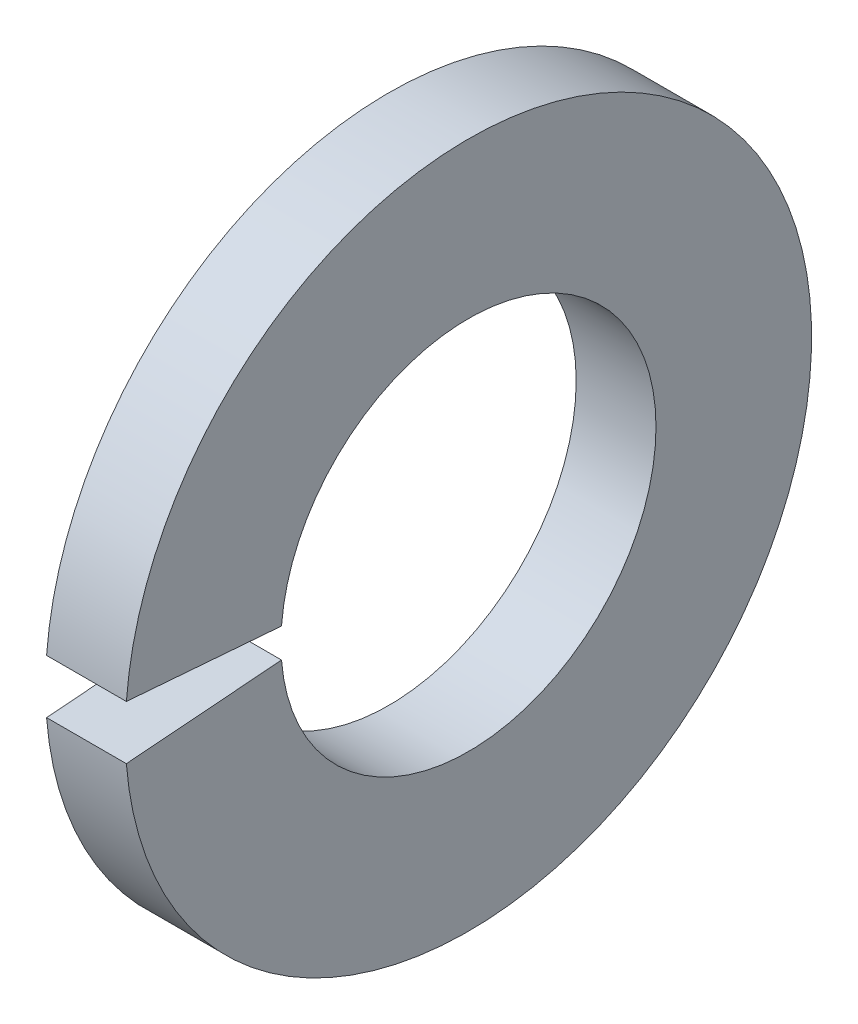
from build123d import *

# Parameters (mm, degrees)
SKETCH1_W = 0.508
SKETCH1_H = 0.9906
GAP_DEPTH = 4.13069812


with BuildPart() as part:
    # Sketch1 → Base-Revolve (revolve)
    with BuildSketch(Plane.XY, mode=Mode.PRIVATE) as base_revolve_sk:
        with Locations((-0.254, 1.6891)):
            Rectangle(SKETCH1_W, SKETCH1_H)
    revolve(base_revolve_sk.sketch.rotate(Axis((-34.925, 0, 0), (1, 0, 0)), 90), axis=Axis((-34.925, 0, 0), (1, 0, 0)))

    # Sketch2 → Gap (cut, through all)
    with BuildSketch(Plane(origin=(0, 0, 0), x_dir=(0, -1, 0), z_dir=(-1, 0, 0))):
        with BuildLine():
            Line((0, 0), (0.17481377, 2.221219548))
            ThreePointArc((0.17481377, 2.221219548), (0, 2.228088), (-0.17481377, 2.221219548))
            Line((-0.17481377, 2.221219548), (0, 0))
        make_face()
    extrude(amount=GAP_DEPTH, mode=Mode.SUBTRACT)


solid = part.part
